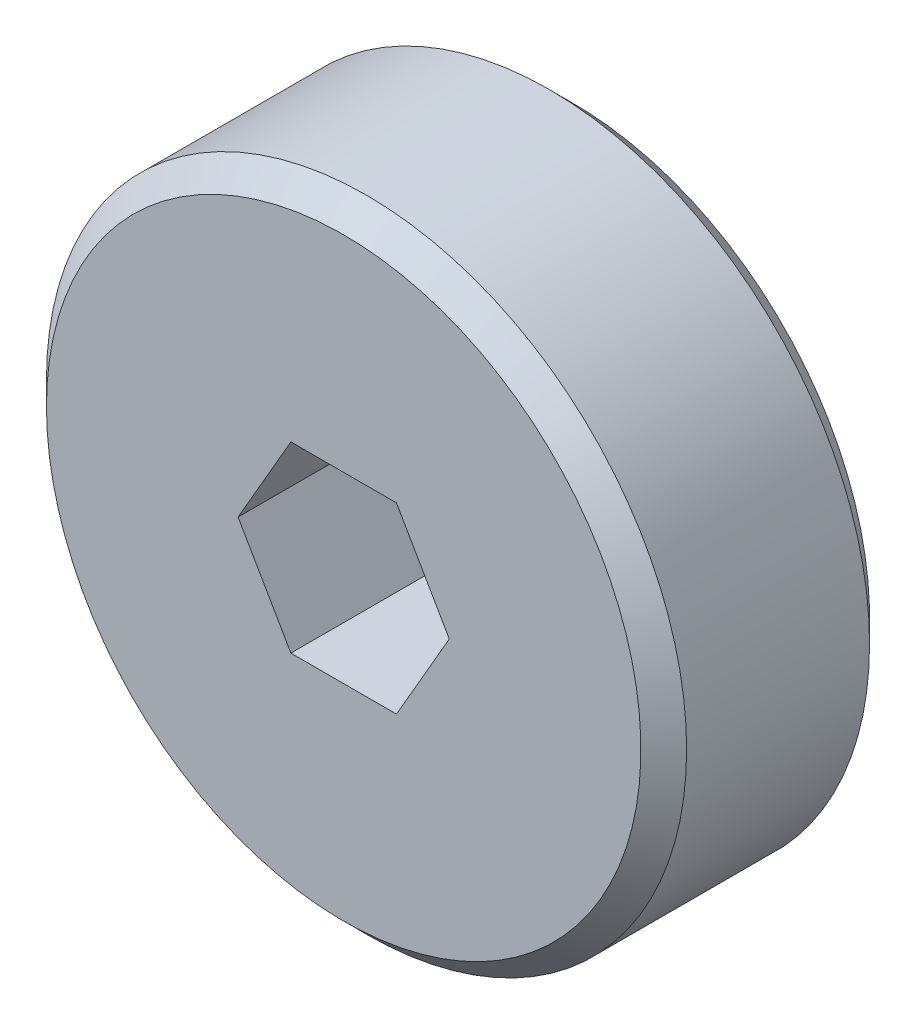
from build123d import *

# Parameters (mm, degrees)
CUT_EXTRUDE1_DEPTH = 18.606226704


with BuildPart() as part:
    # Logo3_bib1 → Revolve1 (revolve)
    with BuildSketch(Plane(origin=(0, 0, 0), x_dir=(-1, 0, 0), z_dir=(0, -1, 0))):
        Polygon((0, -7.9375), (0, 0), (10.31875, 0), (11.1125, -0.79375), (11.1125, -7.14375), (10.31875, -7.9375), align=None)
    revolve(axis=Axis((0, 0, -10.585154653), (0, 0, 1)))

    # Logo3_bib2 → Cut-Extrude1 (cut, through all)
    with BuildSketch(Plane(origin=(0, 0, 0), x_dir=(1, 0, 0), z_dir=(0, 0, -1))):
        Polygon((3.666174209, 0), (1.833087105, 3.175), (-1.833087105, 3.175), (-3.666174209, 0), (-1.833087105, -3.175), (1.833087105, -3.175), align=None)
    extrude(amount=-CUT_EXTRUDE1_DEPTH, mode=Mode.SUBTRACT)


solid = part.part
